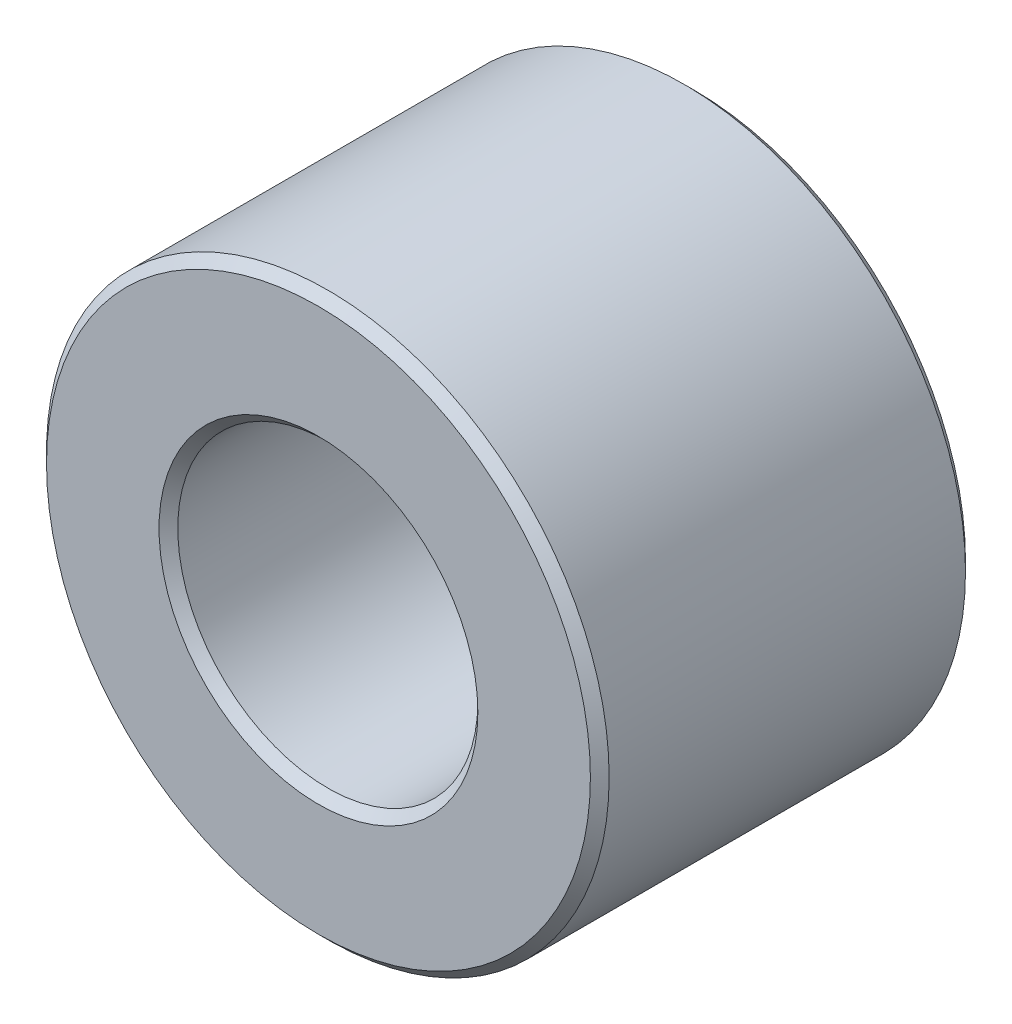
from build123d import *

# Parameters (mm, degrees)
SKETCH1_R           = 3
SKETCH1_R_2         = 1.6
BOSS_EXTRUDE2_DEPTH = 2
CHAMFER3_SIZE       = 0.1


with BuildPart() as part:
    # Sketch1 → Boss-Extrude2 (new, symmetric)
    with BuildSketch(Plane.XY):
        Circle(SKETCH1_R)
        Circle(SKETCH1_R_2, mode=Mode.SUBTRACT)
    extrude(amount=BOSS_EXTRUDE2_DEPTH, both=True)

    # Chamfer3
    chamfer3_edges = [part.edges().sort_by_distance(p)[0] for p in [
        (-3, 0, -2),
        (-3, 0, 2),
        (-1.6, 0, -2),
        (-1.6, 0, 2),
    ]]
    chamfer(chamfer3_edges, length=CHAMFER3_SIZE)


solid = part.part
